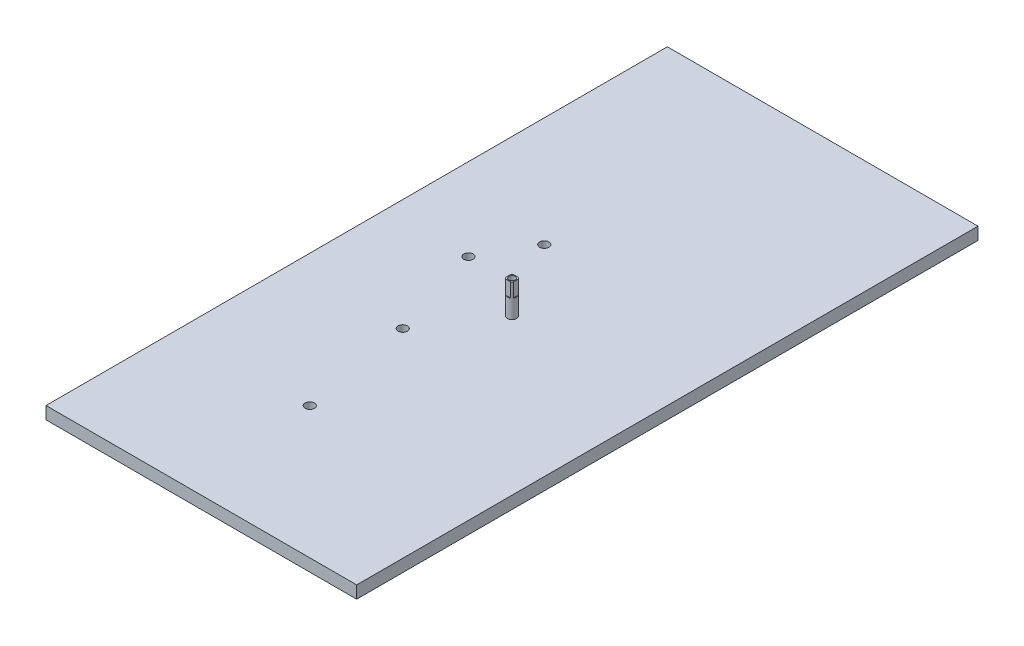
from build123d import *

# Parameters (mm, degrees)
SKETCH2_W           = 100
SKETCH2_H           = 200
BOSS_EXTRUDE1_DEPTH = 4
SKETCH3_R           = 1.5
SKETCH3_R_2         = 1
CUT_EXTRUDE1_DEPTH  = 3
CUT_EXTRUDE2_START  = -3
SKETCH4_R           = 1.5
CUT_EXTRUDE2_DEPTH  = 3
SKETCH5_R           = 1
CUT_EXTRUDE3_DEPTH  = 4
BOSS_EXTRUDE3_START = 10.5
SKETCH8_R           = 1.5
SKETCH8_R_2         = 1
BOSS_EXTRUDE3_DEPTH = 10.5
SKETCH9_W           = 6
SKETCH9_H           = 6
SKETCH9_W_2         = 2.5
SKETCH9_H_2         = 2.5
CUT_EXTRUDE6_DEPTH  = 4.5


with BuildPart() as part:
    # Sketch2 → Boss-Extrude1 (new body)
    with BuildSketch(Plane(origin=(0, 0, 0), x_dir=(1, 0, 0), z_dir=(0, 1, 0))):
        Rectangle(SKETCH2_W, SKETCH2_H)
    extrude(amount=BOSS_EXTRUDE1_DEPTH)

    # Sketch3 → Cut-Extrude1 (cut)
    with BuildSketch(Plane(origin=(0, 0, 0), x_dir=(1, 0, 0), z_dir=(0, 1, 0))):
        with Locations(Location((16.491701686, 59.929013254, 0), (0, 0, 270))):
            Circle(SKETCH3_R)
        with Locations(Location((0, 72.75, 0), (0, 0, 270))):
            Circle(SKETCH3_R)
        with Locations(Location((29, 72.75, 0), (0, 0, 270))):
            Circle(SKETCH3_R)
        with Locations(Location((15.326330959, 85.434220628, 0), (0, 0, 270))):
            Circle(SKETCH3_R)
        with Locations(Location((15.915494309, 0, 0), (0, 0, 270))):
            Circle(SKETCH3_R_2)
        with Locations(Location((-7.497551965, -57.592757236, 0), (0, 0, 270))):
            Circle(SKETCH3_R)
        with Locations(Location((0, -72.75, 0), (0, 0, 270))):
            Circle(SKETCH3_R)
        with Locations(Location((-11.384235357, -87.523552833, 0), (0, 0, 270))):
            Circle(SKETCH3_R)
        with Locations(Location((29.095513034, -72.75, 0), (0, 0, 270))):
            Circle(SKETCH3_R)
        with Locations(Location((-21.5, -72.75, 0), (0, 0, 270))):
            Circle(SKETCH3_R)
        with Locations(Location((-14.666351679, 25.063254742, 0), (0, 0, 270))):
            Circle(SKETCH3_R)
    extrude(amount=CUT_EXTRUDE1_DEPTH, mode=Mode.SUBTRACT)

    # Sketch4 → Cut-Extrude2 (cut)
    with BuildSketch(Plane(origin=(0, 4, 0), x_dir=(1, 0, 0), z_dir=(0, 1, 0)).offset(CUT_EXTRUDE2_START)):
        with Locations(Location((-14.666351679, 25.063254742, 0), (0, 0, 270))):
            Circle(SKETCH4_R)
        with Locations(Location((-23.519128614, 9.5, 0), (0, 0, 270))):
            Circle(SKETCH4_R)
        with Locations(Location((-14.044290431, -21.122436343, 0), (0, 0, 270))):
            Circle(SKETCH4_R)
        with Locations(Location((-7.497551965, -57.592757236, 0), (0, 0, 270))):
            Circle(SKETCH4_R)
    extrude(amount=CUT_EXTRUDE2_DEPTH, mode=Mode.SUBTRACT)

    # Sketch5 → Cut-Extrude3 (cut)
    with BuildSketch(Plane(origin=(0, 4, 0), x_dir=(1, 0, 0), z_dir=(0, 1, 0))):
        with Locations(Location((0, 0, 0), (0, 0, 270))):
            Circle(SKETCH5_R)
    extrude(amount=-CUT_EXTRUDE3_DEPTH, mode=Mode.SUBTRACT)

    # Sketch8 → Boss-Extrude3 (add)
    with BuildSketch(Plane(origin=(0, 4, 0), x_dir=(1, 0, 0), z_dir=(0, 1, 0)).offset(BOSS_EXTRUDE3_START)):
        with Locations(Location((0, 0, 0), (0, 0, 90))):
            Circle(SKETCH8_R)
        with Locations(Location((0, 0, 0), (0, 0, 270))):
            Circle(SKETCH8_R_2, mode=Mode.SUBTRACT)
    extrude(amount=-BOSS_EXTRUDE3_DEPTH)

    # Sketch9 → Cut-Extrude6 (cut)
    with BuildSketch(Plane(origin=(0, 14.5, 0), x_dir=(1, 0, 0), z_dir=(0, 1, 0))):
        Rectangle(SKETCH9_W, SKETCH9_H)
        Rectangle(SKETCH9_W_2, SKETCH9_H_2, mode=Mode.SUBTRACT)
    extrude(amount=-CUT_EXTRUDE6_DEPTH, mode=Mode.SUBTRACT)


solid = part.part
